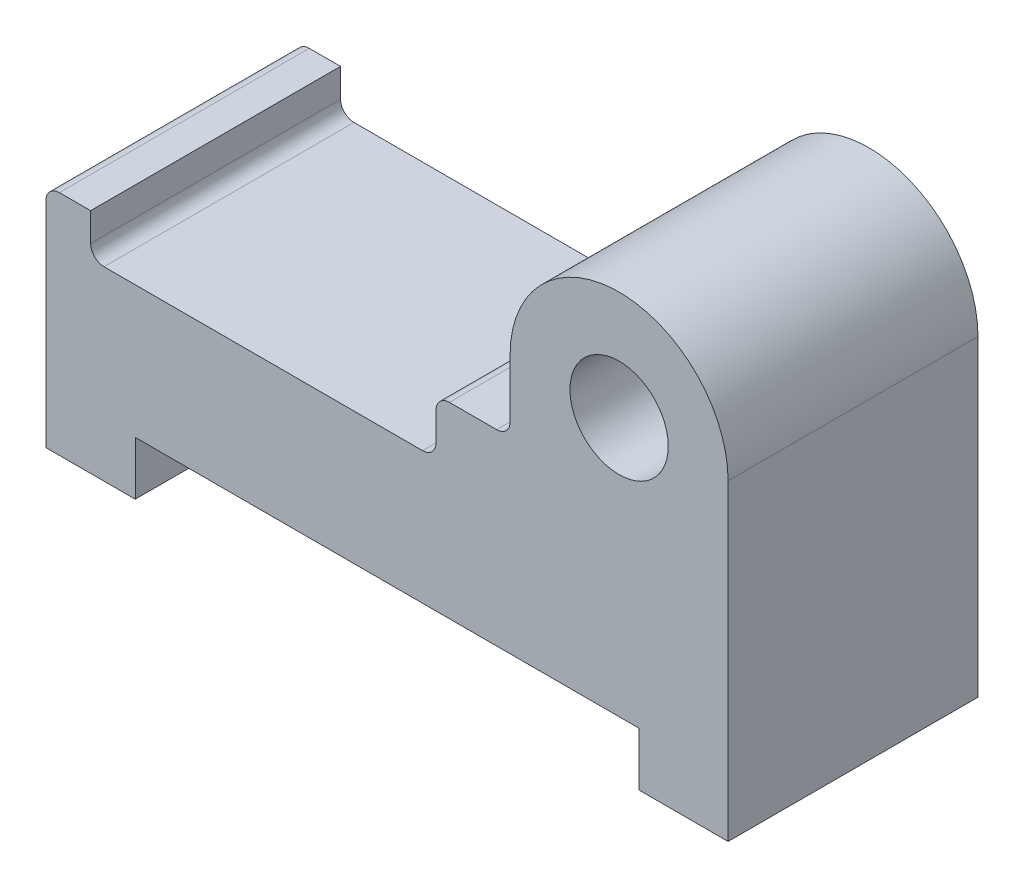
from build123d import *

# Parameters (mm, degrees)
SKETCH1_R      = 11.01372215
EXTRUDE1_DEPTH = 56


with BuildPart() as part:
    # Sketch1 → Extrude1 (new body)
    with BuildSketch(Plane.XY):
        with BuildLine():
            Line((0, 0), (20, 0))
            Line((20, 0), (20, 12))
            Line((20, 12), (132.850151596, 12))
            Line((132.850151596, 12), (132.850151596, 0))
            Line((132.850151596, 0), (152.850151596, 0))
            Line((152.850151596, 0), (152.850151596, 70))
            ThreePointArc((152.850151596, 70), (128.425075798, 94.425075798), (104, 70))
            Line((104, 70), (104, 57))
            ThreePointArc((104, 57), (103.121320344, 54.878679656), (101, 54))
            Line((101, 54), (90.399498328, 54))
            ThreePointArc((90.399498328, 54), (88.278177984, 53.121320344), (87.399498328, 51))
            Line((87.399498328, 51), (87.399498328, 44.617454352))
            ThreePointArc((87.399498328, 44.617454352), (86.520818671, 42.496134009), (84.399498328, 41.617454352))
            Line((84.399498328, 41.617454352), (13, 41.617454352))
            ThreePointArc((13, 41.617454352), (10.878679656, 42.496134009), (10, 44.617454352))
            Line((10, 44.617454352), (10, 51))
            Line((10, 51), (3, 51))
            ThreePointArc((3, 51), (0.878679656, 50.121320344), (0, 48))
            Line((0, 48), (0, 0))
        make_face()
        with Locations((128.425075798, 70)):
            Circle(SKETCH1_R, mode=Mode.SUBTRACT)
    extrude(amount=EXTRUDE1_DEPTH)


solid = part.part
